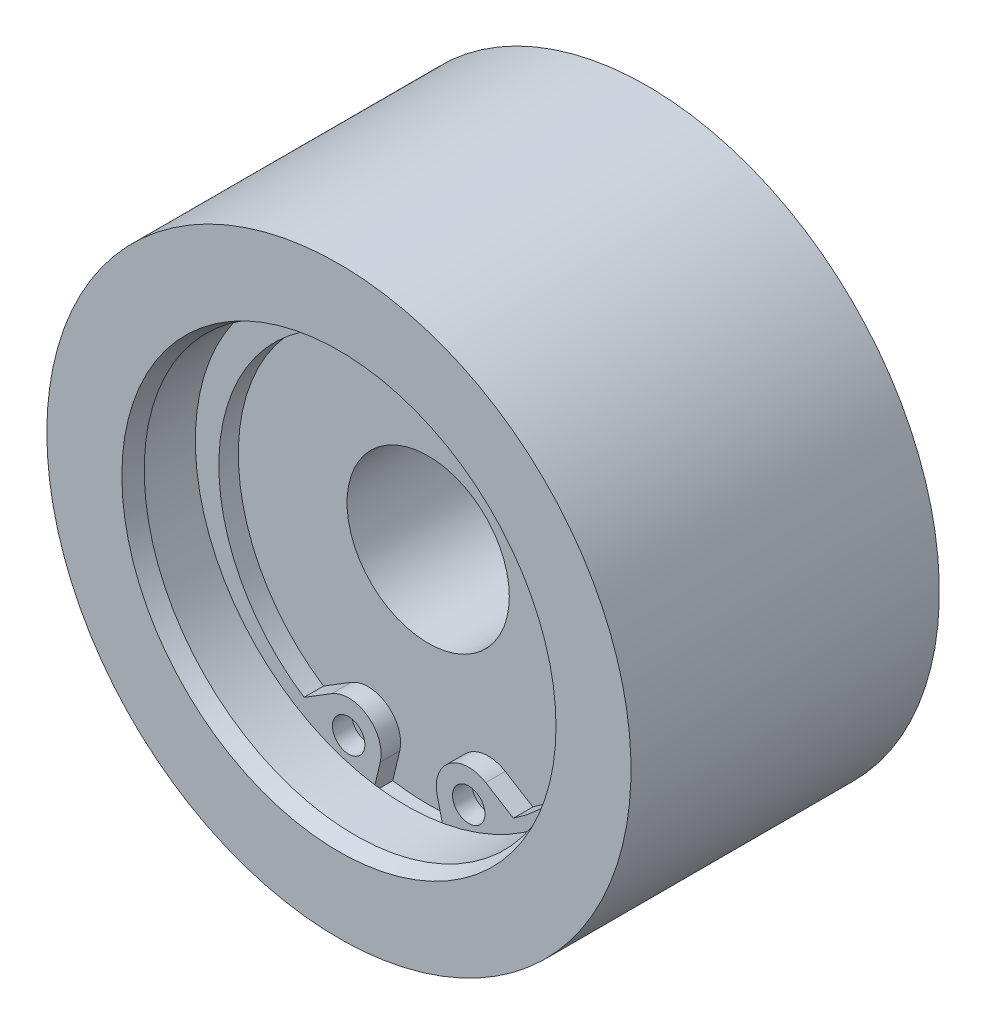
ISO-10303-21;
HEADER;
FILE_DESCRIPTION(('STEP AP214'),'2;1');
FILE_NAME('part.step','',(''),(''),'','','');
FILE_SCHEMA(('AUTOMOTIVE_DESIGN { 1 0 10303 214 1 1 1 1 }'));
ENDSEC;
DATA;
#1=APPLICATION_CONTEXT('core data for automotive mechanical design processes');
#2=APPLICATION_PROTOCOL_DEFINITION('international standard','automotive_design',2000,#1);
#3=PRODUCT_CONTEXT('',#1,'mechanical');
#4=PRODUCT('Part','Part','',(#3));
#5=PRODUCT_RELATED_PRODUCT_CATEGORY('part','',(#4));
#6=PRODUCT_DEFINITION_FORMATION('','',#4);
#7=PRODUCT_DEFINITION_CONTEXT('part definition',#1,'design');
#8=PRODUCT_DEFINITION('design','',#6,#7);
#9=PRODUCT_DEFINITION_SHAPE('','',#8);
#10=(LENGTH_UNIT() NAMED_UNIT(*) SI_UNIT(.MILLI.,.METRE.));
#11=(NAMED_UNIT(*) PLANE_ANGLE_UNIT() SI_UNIT($,.RADIAN.));
#12=(NAMED_UNIT(*) SI_UNIT($,.STERADIAN.) SOLID_ANGLE_UNIT());
#13=UNCERTAINTY_MEASURE_WITH_UNIT(LENGTH_MEASURE(1.E-05),#10,'distance_accuracy_value','');
#14=(GEOMETRIC_REPRESENTATION_CONTEXT(3) GLOBAL_UNCERTAINTY_ASSIGNED_CONTEXT((#13)) GLOBAL_UNIT_ASSIGNED_CONTEXT((#10,
#11,#12)) REPRESENTATION_CONTEXT('',''));
#15=CARTESIAN_POINT('',(0.,0.,0.));
#16=DIRECTION('',(0.,0.,1.));
#17=DIRECTION('',(1.,0.,0.));
#18=AXIS2_PLACEMENT_3D('',#15,#16,#17);
#19=CARTESIAN_POINT('',(0.,0.,-4.6));
#20=DIRECTION('',(0.,0.,1.));
#21=DIRECTION('',(0.,-1.,0.));
#22=AXIS2_PLACEMENT_3D('',#19,#20,#21);
#23=CYLINDRICAL_SURFACE('',#22,18.);
#24=CARTESIAN_POINT('',(0.,0.,9.5));
#25=DIRECTION('',(0.,0.,-1.));
#26=DIRECTION('',(-1.,0.,0.));
#27=AXIS2_PLACEMENT_3D('',#24,#25,#26);
#28=CIRCLE('',#27,18.);
#29=CARTESIAN_POINT('',(-18.,0.,9.5));
#30=VERTEX_POINT('',#29);
#31=EDGE_CURVE('E177',#30,#30,#28,.T.);
#32=ORIENTED_EDGE('',*,*,#31,.T.);
#33=EDGE_LOOP('',(#32));
#34=FACE_BOUND('',#33,.T.);
#35=CARTESIAN_POINT('',(0.,0.,-9.5));
#36=DIRECTION('',(0.,0.,-1.));
#37=DIRECTION('',(-1.,0.,0.));
#38=AXIS2_PLACEMENT_3D('',#35,#36,#37);
#39=CIRCLE('',#38,18.);
#40=CARTESIAN_POINT('',(-18.,0.,-9.5));
#41=VERTEX_POINT('',#40);
#42=EDGE_CURVE('E201',#41,#41,#39,.T.);
#43=ORIENTED_EDGE('',*,*,#42,.F.);
#44=EDGE_LOOP('',(#43));
#45=FACE_BOUND('',#44,.T.);
#46=ADVANCED_FACE('F14',(#34,#45),#23,.T.);
#47=CARTESIAN_POINT('',(-25.3,-25.387056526,-9.5));
#48=DIRECTION('',(0.,0.,1.));
#49=DIRECTION('',(1.,0.,0.));
#50=AXIS2_PLACEMENT_3D('',#47,#48,#49);
#51=PLANE('',#50);
#52=CARTESIAN_POINT('',(0.,0.,-9.5));
#53=DIRECTION('',(0.,0.,1.));
#54=DIRECTION('',(1.,0.,0.));
#55=AXIS2_PLACEMENT_3D('',#52,#53,#54);
#56=CIRCLE('',#55,11.);
#57=CARTESIAN_POINT('',(11.,0.,-9.5));
#58=VERTEX_POINT('',#57);
#59=EDGE_CURVE('E176',#58,#58,#56,.F.);
#60=ORIENTED_EDGE('',*,*,#59,.F.);
#61=EDGE_LOOP('',(#60));
#62=FACE_BOUND('',#61,.T.);
#63=ORIENTED_EDGE('',*,*,#42,.T.);
#64=EDGE_LOOP('',(#63));
#65=FACE_BOUND('',#64,.T.);
#66=ADVANCED_FACE('F257',(#62,#65),#51,.F.);
#67=CARTESIAN_POINT('',(25.3,-25.387056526,9.5));
#68=DIRECTION('',(0.,0.,-1.));
#69=DIRECTION('',(-1.,0.,0.));
#70=AXIS2_PLACEMENT_3D('',#67,#68,#69);
#71=PLANE('',#70);
#72=CARTESIAN_POINT('',(0.,0.,9.5));
#73=DIRECTION('',(0.,0.,1.));
#74=DIRECTION('',(1.,0.,0.));
#75=AXIS2_PLACEMENT_3D('',#72,#73,#74);
#76=CIRCLE('',#75,13.377350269);
#77=CARTESIAN_POINT('',(13.377350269,0.,9.5));
#78=VERTEX_POINT('',#77);
#79=EDGE_CURVE('E172',#78,#78,#76,.T.);
#80=ORIENTED_EDGE('',*,*,#79,.F.);
#81=EDGE_LOOP('',(#80));
#82=FACE_BOUND('',#81,.T.);
#83=ORIENTED_EDGE('',*,*,#31,.F.);
#84=EDGE_LOOP('',(#83));
#85=FACE_BOUND('',#84,.T.);
#86=ADVANCED_FACE('F263',(#82,#85),#71,.F.);
#87=CARTESIAN_POINT('',(0.,0.,-9.5));
#88=DIRECTION('',(0.,0.,1.));
#89=DIRECTION('',(1.,0.,0.));
#90=AXIS2_PLACEMENT_3D('',#87,#88,#89);
#91=CYLINDRICAL_SURFACE('',#90,11.);
#92=ORIENTED_EDGE('',*,*,#59,.T.);
#93=EDGE_LOOP('',(#92));
#94=FACE_BOUND('',#93,.T.);
#95=CARTESIAN_POINT('',(0.,0.,-4.));
#96=DIRECTION('',(0.,0.,1.));
#97=DIRECTION('',(1.,0.,0.));
#98=AXIS2_PLACEMENT_3D('',#95,#96,#97);
#99=CIRCLE('',#98,11.);
#100=CARTESIAN_POINT('',(11.,0.,-4.));
#101=VERTEX_POINT('',#100);
#102=EDGE_CURVE('E173',#101,#101,#99,.T.);
#103=ORIENTED_EDGE('',*,*,#102,.T.);
#104=EDGE_LOOP('',(#103));
#105=FACE_BOUND('',#104,.T.);
#106=ADVANCED_FACE('F275',(#94,#105),#91,.F.);
#107=CARTESIAN_POINT('',(0.,0.,8.5));
#108=DIRECTION('',(0.,0.,1.));
#109=DIRECTION('',(1.,0.,0.));
#110=AXIS2_PLACEMENT_3D('',#107,#108,#109);
#111=CONICAL_SURFACE('',#110,13.,0.360829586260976);
#112=CARTESIAN_POINT('',(0.,0.,8.5));
#113=DIRECTION('',(0.,0.,1.));
#114=DIRECTION('',(1.,0.,0.));
#115=AXIS2_PLACEMENT_3D('',#112,#113,#114);
#116=CIRCLE('',#115,13.);
#117=CARTESIAN_POINT('',(13.,0.,8.49999999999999));
#118=VERTEX_POINT('',#117);
#119=EDGE_CURVE('E194',#118,#118,#116,.T.);
#120=ORIENTED_EDGE('',*,*,#119,.F.);
#121=EDGE_LOOP('',(#120));
#122=FACE_BOUND('',#121,.T.);
#123=ORIENTED_EDGE('',*,*,#79,.T.);
#124=EDGE_LOOP('',(#123));
#125=FACE_BOUND('',#124,.T.);
#126=ADVANCED_FACE('F272',(#122,#125),#111,.F.);
#127=CARTESIAN_POINT('',(-11.132,-11.170304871,-4.));
#128=DIRECTION('',(0.,0.,1.));
#129=DIRECTION('',(1.,0.,0.));
#130=AXIS2_PLACEMENT_3D('',#127,#128,#129);
#131=PLANE('',#130);
#132=CARTESIAN_POINT('',(0.,0.,-4.));
#133=DIRECTION('',(0.,0.,1.));
#134=DIRECTION('',(1.,0.,0.));
#135=AXIS2_PLACEMENT_3D('',#132,#133,#134);
#136=CIRCLE('',#135,5.);
#137=CARTESIAN_POINT('',(5.,0.,-4.));
#138=VERTEX_POINT('',#137);
#139=EDGE_CURVE('E180',#138,#138,#136,.T.);
#140=ORIENTED_EDGE('',*,*,#139,.T.);
#141=EDGE_LOOP('',(#140));
#142=FACE_BOUND('',#141,.T.);
#143=ORIENTED_EDGE('',*,*,#102,.F.);
#144=EDGE_LOOP('',(#143));
#145=FACE_BOUND('',#144,.T.);
#146=ADVANCED_FACE('F270',(#142,#145),#131,.F.);
#147=CARTESIAN_POINT('',(0.,0.,5.35));
#148=DIRECTION('',(0.,0.,1.));
#149=DIRECTION('',(1.,0.,0.));
#150=AXIS2_PLACEMENT_3D('',#147,#148,#149);
#151=CYLINDRICAL_SURFACE('',#150,13.);
#152=CARTESIAN_POINT('',(0.,0.,5.35));
#153=DIRECTION('',(0.,0.,1.));
#154=DIRECTION('',(1.,0.,0.));
#155=AXIS2_PLACEMENT_3D('',#152,#153,#154);
#156=CIRCLE('',#155,13.);
#157=CARTESIAN_POINT('',(13.,0.,5.35));
#158=VERTEX_POINT('',#157);
#159=EDGE_CURVE('E191',#158,#158,#156,.T.);
#160=ORIENTED_EDGE('',*,*,#159,.F.);
#161=EDGE_LOOP('',(#160));
#162=FACE_BOUND('',#161,.T.);
#163=ORIENTED_EDGE('',*,*,#119,.T.);
#164=EDGE_LOOP('',(#163));
#165=FACE_BOUND('',#164,.T.);
#166=ADVANCED_FACE('F246',(#162,#165),#151,.F.);
#167=CARTESIAN_POINT('',(0.,0.,-4.));
#168=DIRECTION('',(0.,0.,1.));
#169=DIRECTION('',(1.,0.,0.));
#170=AXIS2_PLACEMENT_3D('',#167,#168,#169);
#171=CYLINDRICAL_SURFACE('',#170,5.);
#172=ORIENTED_EDGE('',*,*,#139,.F.);
#173=EDGE_LOOP('',(#172));
#174=FACE_BOUND('',#173,.T.);
#175=CARTESIAN_POINT('',(0.,0.,4.));
#176=DIRECTION('',(0.,0.,1.));
#177=DIRECTION('',(1.,0.,0.));
#178=AXIS2_PLACEMENT_3D('',#175,#176,#177);
#179=CIRCLE('',#178,5.);
#180=CARTESIAN_POINT('',(5.,0.,4.));
#181=VERTEX_POINT('',#180);
#182=EDGE_CURVE('E183',#181,#181,#179,.T.);
#183=ORIENTED_EDGE('',*,*,#182,.T.);
#184=EDGE_LOOP('',(#183));
#185=FACE_BOUND('',#184,.T.);
#186=ADVANCED_FACE('F233',(#174,#185),#171,.F.);
#187=CARTESIAN_POINT('',(13.7632,-13.81055875,4.));
#188=DIRECTION('',(0.,0.,-1.));
#189=DIRECTION('',(-1.,0.,0.));
#190=AXIS2_PLACEMENT_3D('',#187,#188,#189);
#191=PLANE('',#190);
#192=ORIENTED_EDGE('',*,*,#182,.F.);
#193=EDGE_LOOP('',(#192));
#194=FACE_BOUND('',#193,.T.);
#195=DIRECTION('',(0.231349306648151,-0.972870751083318,0.));
#196=VECTOR('',#195,1.);
#197=CARTESIAN_POINT('',(2.88824186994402,-16.3966309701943,4.));
#198=LINE('',#197,#196);
#199=CARTESIAN_POINT('',(1.75425849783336,-11.6280009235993,4.));
#200=VERTEX_POINT('',#199);
#201=CARTESIAN_POINT('',(2.1813307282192,-13.4239262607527,4.));
#202=VERTEX_POINT('',#201);
#203=EDGE_CURVE('E9',#200,#202,#198,.T.);
#204=ORIENTED_EDGE('',*,*,#203,.F.);
#205=CARTESIAN_POINT('',(3.7,-11.165302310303,4.));
#206=DIRECTION('',(0.,0.,-1.));
#207=DIRECTION('',(-1.,0.,0.));
#208=AXIS2_PLACEMENT_3D('',#205,#206,#207);
#209=CIRCLE('',#208,2.);
#210=CARTESIAN_POINT('',(4.74866968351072,-9.46227797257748,4.));
#211=VERTEX_POINT('',#210);
#212=EDGE_CURVE('E25',#200,#211,#209,.T.);
#213=ORIENTED_EDGE('',*,*,#212,.T.);
#214=DIRECTION('',(-0.851512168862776,0.524334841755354,0.));
#215=VECTOR('',#214,1.);
#216=CARTESIAN_POINT('',(13.2262715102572,-14.6825228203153,4.));
#217=LINE('',#216,#215);
#218=CARTESIAN_POINT('',(6.45127454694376,-10.5106893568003,4.));
#219=VERTEX_POINT('',#218);
#220=EDGE_CURVE('E141',#219,#211,#217,.T.);
#221=ORIENTED_EDGE('',*,*,#220,.F.);
#222=CARTESIAN_POINT('',(0.,-0.75,4.));
#223=DIRECTION('',(0.,0.,-1.));
#224=DIRECTION('',(-1.,0.,0.));
#225=AXIS2_PLACEMENT_3D('',#222,#223,#224);
#226=CIRCLE('',#225,11.7);
#227=CARTESIAN_POINT('',(-6.45127454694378,-10.5106893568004,4.));
#228=VERTEX_POINT('',#227);
#229=EDGE_CURVE('E144',#228,#219,#226,.T.);
#230=ORIENTED_EDGE('',*,*,#229,.F.);
#231=DIRECTION('',(-0.851512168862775,-0.524334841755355,0.));
#232=VECTOR('',#231,1.);
#233=CARTESIAN_POINT('',(6.73237719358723,-2.39260461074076,4.));
#234=LINE('',#233,#232);
#235=CARTESIAN_POINT('',(-4.74866968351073,-9.46227797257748,4.));
#236=VERTEX_POINT('',#235);
#237=EDGE_CURVE('E148',#236,#228,#234,.T.);
#238=ORIENTED_EDGE('',*,*,#237,.F.);
#239=CARTESIAN_POINT('',(-3.7,-11.165302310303,4.));
#240=DIRECTION('',(0.,0.,-1.));
#241=DIRECTION('',(-1.,0.,0.));
#242=AXIS2_PLACEMENT_3D('',#239,#240,#241);
#243=CIRCLE('',#242,2.);
#244=CARTESIAN_POINT('',(-1.75425849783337,-11.6280009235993,4.));
#245=VERTEX_POINT('',#244);
#246=EDGE_CURVE('E155',#236,#245,#243,.T.);
#247=ORIENTED_EDGE('',*,*,#246,.T.);
#248=DIRECTION('',(0.231349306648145,0.97287075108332,0.));
#249=VECTOR('',#248,1.);
#250=CARTESIAN_POINT('',(-1.41496007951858,-10.2011822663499,4.));
#251=LINE('',#250,#249);
#252=CARTESIAN_POINT('',(-2.18133072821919,-13.4239262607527,4.));
#253=VERTEX_POINT('',#252);
#254=EDGE_CURVE('E152',#253,#245,#251,.T.);
#255=ORIENTED_EDGE('',*,*,#254,.F.);
#256=CARTESIAN_POINT('',(0.,0.,4.));
#257=DIRECTION('',(0.,0.,1.));
#258=DIRECTION('',(0.,-1.,0.));
#259=AXIS2_PLACEMENT_3D('',#256,#257,#258);
#260=CIRCLE('',#259,13.6);
#261=EDGE_CURVE('E186',#253,#202,#260,.T.);
#262=ORIENTED_EDGE('',*,*,#261,.T.);
#263=EDGE_LOOP('',(#204,#213,#221,#230,#238,#247,#255,#262));
#264=FACE_BOUND('',#263,.T.);
#265=ADVANCED_FACE('F230',(#194,#264),#191,.F.);
#266=CARTESIAN_POINT('',(-13.7632,-13.81055875,5.35));
#267=DIRECTION('',(0.,0.,1.));
#268=DIRECTION('',(1.,0.,0.));
#269=AXIS2_PLACEMENT_3D('',#266,#267,#268);
#270=PLANE('',#269);
#271=ORIENTED_EDGE('',*,*,#159,.T.);
#272=EDGE_LOOP('',(#271));
#273=FACE_BOUND('',#272,.T.);
#274=CARTESIAN_POINT('',(0.,0.,5.35));
#275=DIRECTION('',(0.,0.,1.));
#276=DIRECTION('',(0.,-1.,0.));
#277=AXIS2_PLACEMENT_3D('',#274,#275,#276);
#278=CIRCLE('',#277,13.6);
#279=CARTESIAN_POINT('',(0.,-13.6,5.35));
#280=VERTEX_POINT('',#279);
#281=EDGE_CURVE('E188',#280,#280,#278,.T.);
#282=ORIENTED_EDGE('',*,*,#281,.F.);
#283=EDGE_LOOP('',(#282));
#284=FACE_BOUND('',#283,.T.);
#285=ADVANCED_FACE('F232',(#273,#284),#270,.F.);
#286=CARTESIAN_POINT('',(0.,0.,4.));
#287=DIRECTION('',(0.,0.,1.));
#288=DIRECTION('',(0.,-1.,0.));
#289=AXIS2_PLACEMENT_3D('',#286,#287,#288);
#290=CYLINDRICAL_SURFACE('',#289,13.6);
#291=ORIENTED_EDGE('',*,*,#281,.T.);
#292=EDGE_LOOP('',(#291));
#293=FACE_BOUND('',#292,.T.);
#294=CARTESIAN_POINT('',(0.,0.,5.2));
#295=DIRECTION('',(0.,0.,-1.));
#296=DIRECTION('',(-1.,0.,0.));
#297=AXIS2_PLACEMENT_3D('',#294,#295,#296);
#298=CIRCLE('',#297,13.6);
#299=CARTESIAN_POINT('',(-2.18133072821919,-13.4239262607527,5.2));
#300=VERTEX_POINT('',#299);
#301=CARTESIAN_POINT('',(2.1813307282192,-13.4239262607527,5.2));
#302=VERTEX_POINT('',#301);
#303=EDGE_CURVE('E167',#300,#302,#298,.T.);
#304=ORIENTED_EDGE('',*,*,#303,.T.);
#305=DIRECTION('',(0.,0.,1.));
#306=VECTOR('',#305,1.);
#307=CARTESIAN_POINT('',(2.1813307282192,-13.4239262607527,4.));
#308=LINE('',#307,#306);
#309=EDGE_CURVE('E85',#302,#202,#308,.F.);
#310=ORIENTED_EDGE('',*,*,#309,.T.);
#311=ORIENTED_EDGE('',*,*,#261,.F.);
#312=DIRECTION('',(0.,0.,1.));
#313=VECTOR('',#312,1.);
#314=CARTESIAN_POINT('',(-2.18133072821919,-13.4239262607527,4.));
#315=LINE('',#314,#313);
#316=EDGE_CURVE('E169',#253,#300,#315,.T.);
#317=ORIENTED_EDGE('',*,*,#316,.T.);
#318=EDGE_LOOP('',(#304,#310,#311,#317));
#319=FACE_BOUND('',#318,.T.);
#320=ADVANCED_FACE('F243',(#293,#319),#290,.F.);
#321=CARTESIAN_POINT('',(3.7,-11.165302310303,4.));
#322=DIRECTION('',(0.,0.,-1.));
#323=DIRECTION('',(-1.,0.,0.));
#324=AXIS2_PLACEMENT_3D('',#321,#322,#323);
#325=CIRCLE('',#324,1.);
#326=CARTESIAN_POINT('',(2.7,-11.165302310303,4.));
#327=VERTEX_POINT('',#326);
#328=EDGE_CURVE('E163',#327,#327,#325,.T.);
#329=ORIENTED_EDGE('',*,*,#328,.F.);
#330=EDGE_LOOP('',(#329));
#331=FACE_BOUND('',#330,.T.);
#332=ADVANCED_FACE('F237',(#331),#191,.F.);
#333=CARTESIAN_POINT('',(-3.7,-11.165302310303,4.));
#334=DIRECTION('',(0.,0.,-1.));
#335=DIRECTION('',(-1.,0.,0.));
#336=AXIS2_PLACEMENT_3D('',#333,#334,#335);
#337=CIRCLE('',#336,1.);
#338=CARTESIAN_POINT('',(-4.7,-11.165302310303,4.));
#339=VERTEX_POINT('',#338);
#340=EDGE_CURVE('E159',#339,#339,#337,.T.);
#341=ORIENTED_EDGE('',*,*,#340,.F.);
#342=EDGE_LOOP('',(#341));
#343=FACE_BOUND('',#342,.T.);
#344=ADVANCED_FACE('F236',(#343),#191,.F.);
#345=CARTESIAN_POINT('',(4.74866968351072,-9.46227797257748,5.2));
#346=DIRECTION('',(-0.524334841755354,-0.851512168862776,0.));
#347=DIRECTION('',(-0.851512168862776,0.524334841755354,0.));
#348=AXIS2_PLACEMENT_3D('',#345,#346,#347);
#349=PLANE('',#348);
#350=ORIENTED_EDGE('',*,*,#220,.T.);
#351=DIRECTION('',(0.,0.,-1.));
#352=VECTOR('',#351,1.);
#353=CARTESIAN_POINT('',(4.74866968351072,-9.46227797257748,5.2));
#354=LINE('',#353,#352);
#355=CARTESIAN_POINT('',(4.74866968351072,-9.46227797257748,5.2));
#356=VERTEX_POINT('',#355);
#357=EDGE_CURVE('E101',#356,#211,#354,.T.);
#358=ORIENTED_EDGE('',*,*,#357,.F.);
#359=DIRECTION('',(-0.851512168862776,0.524334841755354,0.));
#360=VECTOR('',#359,1.);
#361=CARTESIAN_POINT('',(4.74866968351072,-9.46227797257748,5.2));
#362=LINE('',#361,#360);
#363=CARTESIAN_POINT('',(6.45127454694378,-10.5106893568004,5.2));
#364=VERTEX_POINT('',#363);
#365=EDGE_CURVE('E94',#364,#356,#362,.T.);
#366=ORIENTED_EDGE('',*,*,#365,.F.);
#367=DIRECTION('',(0.,0.,-1.));
#368=VECTOR('',#367,1.);
#369=CARTESIAN_POINT('',(6.45127454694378,-10.5106893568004,5.2));
#370=LINE('',#369,#368);
#371=EDGE_CURVE('E125',#364,#219,#370,.T.);
#372=ORIENTED_EDGE('',*,*,#371,.T.);
#373=EDGE_LOOP('',(#350,#358,#366,#372));
#374=FACE_BOUND('',#373,.T.);
#375=ADVANCED_FACE('F228',(#374),#349,.F.);
#376=CARTESIAN_POINT('',(0.,-0.75,5.2));
#377=DIRECTION('',(0.,0.,1.));
#378=DIRECTION('',(-1.,0.,0.));
#379=AXIS2_PLACEMENT_3D('',#376,#377,#378);
#380=CYLINDRICAL_SURFACE('',#379,11.7);
#381=ORIENTED_EDGE('',*,*,#229,.T.);
#382=ORIENTED_EDGE('',*,*,#371,.F.);
#383=CARTESIAN_POINT('',(0.,-0.75,5.2));
#384=DIRECTION('',(0.,0.,-1.));
#385=DIRECTION('',(0.,-1.,0.));
#386=AXIS2_PLACEMENT_3D('',#383,#384,#385);
#387=CIRCLE('',#386,11.7);
#388=CARTESIAN_POINT('',(-6.45127454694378,-10.5106893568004,5.2));
#389=VERTEX_POINT('',#388);
#390=EDGE_CURVE('E128',#389,#364,#387,.T.);
#391=ORIENTED_EDGE('',*,*,#390,.F.);
#392=DIRECTION('',(0.,0.,-1.));
#393=VECTOR('',#392,1.);
#394=CARTESIAN_POINT('',(-6.45127454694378,-10.5106893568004,5.2));
#395=LINE('',#394,#393);
#396=EDGE_CURVE('E121',#389,#228,#395,.T.);
#397=ORIENTED_EDGE('',*,*,#396,.T.);
#398=EDGE_LOOP('',(#381,#382,#391,#397));
#399=FACE_BOUND('',#398,.T.);
#400=ADVANCED_FACE('F16',(#399),#380,.F.);
#401=CARTESIAN_POINT('',(-4.74866968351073,-9.46227797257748,5.2));
#402=DIRECTION('',(0.524334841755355,-0.851512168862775,0.));
#403=DIRECTION('',(0.,0.,-1.));
#404=AXIS2_PLACEMENT_3D('',#401,#402,#403);
#405=PLANE('',#404);
#406=ORIENTED_EDGE('',*,*,#237,.T.);
#407=ORIENTED_EDGE('',*,*,#396,.F.);
#408=DIRECTION('',(-0.851512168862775,-0.524334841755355,0.));
#409=VECTOR('',#408,1.);
#410=CARTESIAN_POINT('',(-4.74866968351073,-9.46227797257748,5.2));
#411=LINE('',#410,#409);
#412=CARTESIAN_POINT('',(-4.74866968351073,-9.46227797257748,5.2));
#413=VERTEX_POINT('',#412);
#414=EDGE_CURVE('E129',#413,#389,#411,.T.);
#415=ORIENTED_EDGE('',*,*,#414,.F.);
#416=DIRECTION('',(0.,0.,-1.));
#417=VECTOR('',#416,1.);
#418=CARTESIAN_POINT('',(-4.74866968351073,-9.46227797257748,5.2));
#419=LINE('',#418,#417);
#420=EDGE_CURVE('E18',#413,#236,#419,.T.);
#421=ORIENTED_EDGE('',*,*,#420,.T.);
#422=EDGE_LOOP('',(#406,#407,#415,#421));
#423=FACE_BOUND('',#422,.T.);
#424=ADVANCED_FACE('F212',(#423),#405,.F.);
#425=CARTESIAN_POINT('',(-3.7,-11.165302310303,5.2));
#426=DIRECTION('',(0.,0.,1.));
#427=DIRECTION('',(-1.,0.,0.));
#428=AXIS2_PLACEMENT_3D('',#425,#426,#427);
#429=CYLINDRICAL_SURFACE('',#428,1.);
#430=ORIENTED_EDGE('',*,*,#340,.T.);
#431=EDGE_LOOP('',(#430));
#432=FACE_BOUND('',#431,.T.);
#433=CARTESIAN_POINT('',(-3.7,-11.165302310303,5.2));
#434=DIRECTION('',(0.,0.,-1.));
#435=DIRECTION('',(1.,0.,0.));
#436=AXIS2_PLACEMENT_3D('',#433,#434,#435);
#437=CIRCLE('',#436,1.);
#438=CARTESIAN_POINT('',(-2.7,-11.165302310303,5.2));
#439=VERTEX_POINT('',#438);
#440=EDGE_CURVE('E106',#439,#439,#437,.T.);
#441=ORIENTED_EDGE('',*,*,#440,.F.);
#442=EDGE_LOOP('',(#441));
#443=FACE_BOUND('',#442,.T.);
#444=ADVANCED_FACE('F309',(#432,#443),#429,.F.);
#445=CARTESIAN_POINT('',(3.7,-11.165302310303,5.2));
#446=DIRECTION('',(0.,0.,1.));
#447=DIRECTION('',(-1.,0.,0.));
#448=AXIS2_PLACEMENT_3D('',#445,#446,#447);
#449=CYLINDRICAL_SURFACE('',#448,1.);
#450=ORIENTED_EDGE('',*,*,#328,.T.);
#451=EDGE_LOOP('',(#450));
#452=FACE_BOUND('',#451,.T.);
#453=CARTESIAN_POINT('',(3.7,-11.165302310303,5.2));
#454=DIRECTION('',(0.,0.,1.));
#455=DIRECTION('',(1.,0.,0.));
#456=AXIS2_PLACEMENT_3D('',#453,#454,#455);
#457=CIRCLE('',#456,1.);
#458=CARTESIAN_POINT('',(4.7,-11.165302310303,5.2));
#459=VERTEX_POINT('',#458);
#460=EDGE_CURVE('E109',#459,#459,#457,.T.);
#461=ORIENTED_EDGE('',*,*,#460,.T.);
#462=EDGE_LOOP('',(#461));
#463=FACE_BOUND('',#462,.T.);
#464=ADVANCED_FACE('F255',(#452,#463),#449,.F.);
#465=CARTESIAN_POINT('',(3.7,-11.165302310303,5.2));
#466=DIRECTION('',(0.,0.,1.));
#467=DIRECTION('',(-1.,0.,0.));
#468=AXIS2_PLACEMENT_3D('',#465,#466,#467);
#469=CYLINDRICAL_SURFACE('',#468,2.);
#470=ORIENTED_EDGE('',*,*,#212,.F.);
#471=DIRECTION('',(0.,0.,-1.));
#472=VECTOR('',#471,1.);
#473=CARTESIAN_POINT('',(1.75425849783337,-11.6280009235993,5.2));
#474=LINE('',#473,#472);
#475=CARTESIAN_POINT('',(1.75425849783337,-11.6280009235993,5.2));
#476=VERTEX_POINT('',#475);
#477=EDGE_CURVE('E82',#476,#200,#474,.T.);
#478=ORIENTED_EDGE('',*,*,#477,.F.);
#479=CARTESIAN_POINT('',(3.7,-11.165302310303,5.2));
#480=DIRECTION('',(0.,0.,1.));
#481=DIRECTION('',(1.,0.,0.));
#482=AXIS2_PLACEMENT_3D('',#479,#480,#481);
#483=CIRCLE('',#482,2.);
#484=EDGE_CURVE('E88',#356,#476,#483,.T.);
#485=ORIENTED_EDGE('',*,*,#484,.F.);
#486=ORIENTED_EDGE('',*,*,#357,.T.);
#487=EDGE_LOOP('',(#470,#478,#485,#486));
#488=FACE_BOUND('',#487,.T.);
#489=ADVANCED_FACE('F99',(#488),#469,.T.);
#490=CARTESIAN_POINT('',(0.,-0.75,5.2));
#491=DIRECTION('',(0.,0.,-1.));
#492=DIRECTION('',(0.,-1.,0.));
#493=AXIS2_PLACEMENT_3D('',#490,#491,#492);
#494=PLANE('',#493);
#495=ORIENTED_EDGE('',*,*,#460,.F.);
#496=EDGE_LOOP('',(#495));
#497=FACE_BOUND('',#496,.T.);
#498=ORIENTED_EDGE('',*,*,#440,.T.);
#499=EDGE_LOOP('',(#498));
#500=FACE_BOUND('',#499,.T.);
#501=ORIENTED_EDGE('',*,*,#303,.F.);
#502=DIRECTION('',(0.231349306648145,0.97287075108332,0.));
#503=VECTOR('',#502,1.);
#504=CARTESIAN_POINT('',(-1.75425849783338,-11.6280009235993,5.2));
#505=LINE('',#504,#503);
#506=CARTESIAN_POINT('',(-1.75425849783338,-11.6280009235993,5.2));
#507=VERTEX_POINT('',#506);
#508=EDGE_CURVE('E70',#300,#507,#505,.T.);
#509=ORIENTED_EDGE('',*,*,#508,.T.);
#510=CARTESIAN_POINT('',(-3.7,-11.165302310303,5.2));
#511=DIRECTION('',(0.,0.,1.));
#512=DIRECTION('',(-1.,0.,0.));
#513=AXIS2_PLACEMENT_3D('',#510,#511,#512);
#514=CIRCLE('',#513,2.);
#515=EDGE_CURVE('E114',#507,#413,#514,.T.);
#516=ORIENTED_EDGE('',*,*,#515,.T.);
#517=ORIENTED_EDGE('',*,*,#414,.T.);
#518=ORIENTED_EDGE('',*,*,#390,.T.);
#519=ORIENTED_EDGE('',*,*,#365,.T.);
#520=ORIENTED_EDGE('',*,*,#484,.T.);
#521=DIRECTION('',(0.231349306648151,-0.972870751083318,0.));
#522=VECTOR('',#521,1.);
#523=CARTESIAN_POINT('',(1.75425849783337,-11.6280009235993,5.2));
#524=LINE('',#523,#522);
#525=EDGE_CURVE('E78',#476,#302,#524,.T.);
#526=ORIENTED_EDGE('',*,*,#525,.T.);
#527=EDGE_LOOP('',(#501,#509,#516,#517,#518,#519,#520,#526));
#528=FACE_BOUND('',#527,.T.);
#529=ADVANCED_FACE('F92',(#497,#500,#528),#494,.F.);
#530=CARTESIAN_POINT('',(-3.7,-11.165302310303,5.2));
#531=DIRECTION('',(0.,0.,1.));
#532=DIRECTION('',(-1.,0.,0.));
#533=AXIS2_PLACEMENT_3D('',#530,#531,#532);
#534=CYLINDRICAL_SURFACE('',#533,2.);
#535=ORIENTED_EDGE('',*,*,#246,.F.);
#536=ORIENTED_EDGE('',*,*,#420,.F.);
#537=ORIENTED_EDGE('',*,*,#515,.F.);
#538=DIRECTION('',(0.,0.,-1.));
#539=VECTOR('',#538,1.);
#540=CARTESIAN_POINT('',(-1.75425849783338,-11.6280009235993,5.2));
#541=LINE('',#540,#539);
#542=EDGE_CURVE('E102',#507,#245,#541,.T.);
#543=ORIENTED_EDGE('',*,*,#542,.T.);
#544=EDGE_LOOP('',(#535,#536,#537,#543));
#545=FACE_BOUND('',#544,.T.);
#546=ADVANCED_FACE('F221',(#545),#534,.T.);
#547=CARTESIAN_POINT('',(-1.75425849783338,-11.6280009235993,5.2));
#548=DIRECTION('',(-0.97287075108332,0.231349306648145,0.));
#549=DIRECTION('',(0.,0.,1.));
#550=AXIS2_PLACEMENT_3D('',#547,#548,#549);
#551=PLANE('',#550);
#552=ORIENTED_EDGE('',*,*,#316,.F.);
#553=ORIENTED_EDGE('',*,*,#254,.T.);
#554=ORIENTED_EDGE('',*,*,#542,.F.);
#555=ORIENTED_EDGE('',*,*,#508,.F.);
#556=EDGE_LOOP('',(#552,#553,#554,#555));
#557=FACE_BOUND('',#556,.T.);
#558=ADVANCED_FACE('F303',(#557),#551,.F.);
#559=CARTESIAN_POINT('',(1.75425849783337,-11.6280009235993,5.2));
#560=DIRECTION('',(0.972870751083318,0.231349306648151,0.));
#561=DIRECTION('',(0.,0.,-1.));
#562=AXIS2_PLACEMENT_3D('',#559,#560,#561);
#563=PLANE('',#562);
#564=ORIENTED_EDGE('',*,*,#309,.F.);
#565=ORIENTED_EDGE('',*,*,#525,.F.);
#566=ORIENTED_EDGE('',*,*,#477,.T.);
#567=ORIENTED_EDGE('',*,*,#203,.T.);
#568=EDGE_LOOP('',(#564,#565,#566,#567));
#569=FACE_BOUND('',#568,.T.);
#570=ADVANCED_FACE('F80',(#569),#563,.F.);
#571=CLOSED_SHELL('',(#46,#66,#86,#106,#126,#146,#166,#186,#265,#285,#320,#332,#344,#375,#400,
#424,#444,#464,#489,#529,#546,#558,#570));
#572=MANIFOLD_SOLID_BREP('B1',#571);
#573=ADVANCED_BREP_SHAPE_REPRESENTATION('',(#18,#572),#14);
#574=SHAPE_DEFINITION_REPRESENTATION(#9,#573);
ENDSEC;
END-ISO-10303-21;
